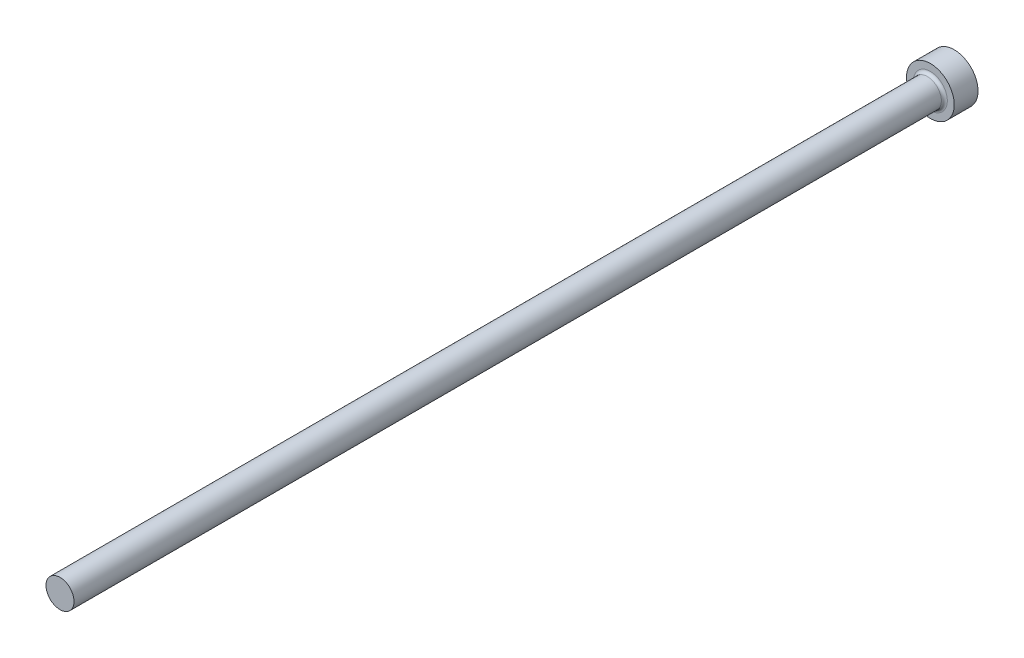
ISO-10303-21;
HEADER;
FILE_DESCRIPTION(('STEP AP214'),'2;1');
FILE_NAME('part.step','',(''),(''),'','','');
FILE_SCHEMA(('AUTOMOTIVE_DESIGN { 1 0 10303 214 1 1 1 1 }'));
ENDSEC;
DATA;
#1=APPLICATION_CONTEXT('core data for automotive mechanical design processes');
#2=APPLICATION_PROTOCOL_DEFINITION('international standard','automotive_design',2000,#1);
#3=PRODUCT_CONTEXT('',#1,'mechanical');
#4=PRODUCT('Part','Part','',(#3));
#5=PRODUCT_RELATED_PRODUCT_CATEGORY('part','',(#4));
#6=PRODUCT_DEFINITION_FORMATION('','',#4);
#7=PRODUCT_DEFINITION_CONTEXT('part definition',#1,'design');
#8=PRODUCT_DEFINITION('design','',#6,#7);
#9=PRODUCT_DEFINITION_SHAPE('','',#8);
#10=(LENGTH_UNIT() NAMED_UNIT(*) SI_UNIT(.MILLI.,.METRE.));
#11=(NAMED_UNIT(*) PLANE_ANGLE_UNIT() SI_UNIT($,.RADIAN.));
#12=(NAMED_UNIT(*) SI_UNIT($,.STERADIAN.) SOLID_ANGLE_UNIT());
#13=UNCERTAINTY_MEASURE_WITH_UNIT(LENGTH_MEASURE(1.E-05),#10,'distance_accuracy_value','');
#14=(GEOMETRIC_REPRESENTATION_CONTEXT(3) GLOBAL_UNCERTAINTY_ASSIGNED_CONTEXT((#13)) GLOBAL_UNIT_ASSIGNED_CONTEXT((#10,
#11,#12)) REPRESENTATION_CONTEXT('',''));
#15=CARTESIAN_POINT('',(0.,0.,0.));
#16=DIRECTION('',(0.,0.,1.));
#17=DIRECTION('',(1.,0.,0.));
#18=AXIS2_PLACEMENT_3D('',#15,#16,#17);
#19=CARTESIAN_POINT('',(4.,0.,4.));
#20=DIRECTION('',(0.,0.,-1.));
#21=DIRECTION('',(-1.,0.,0.));
#22=AXIS2_PLACEMENT_3D('',#19,#20,#21);
#23=PLANE('',#22);
#24=CARTESIAN_POINT('',(0.,0.,4.));
#25=DIRECTION('',(0.,0.,-1.));
#26=DIRECTION('',(-1.,0.,0.));
#27=AXIS2_PLACEMENT_3D('',#24,#25,#26);
#28=CIRCLE('',#27,2.85000000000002);
#29=CARTESIAN_POINT('',(-2.85000000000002,0.,4.));
#30=VERTEX_POINT('',#29);
#31=EDGE_CURVE('E40',#30,#30,#28,.T.);
#32=ORIENTED_EDGE('',*,*,#31,.T.);
#33=EDGE_LOOP('',(#32));
#34=FACE_BOUND('',#33,.T.);
#35=CARTESIAN_POINT('',(0.,0.,4.));
#36=DIRECTION('',(0.,0.,-1.));
#37=DIRECTION('',(-1.,0.,0.));
#38=AXIS2_PLACEMENT_3D('',#35,#36,#37);
#39=CIRCLE('',#38,4.);
#40=CARTESIAN_POINT('',(-4.,0.,4.));
#41=VERTEX_POINT('',#40);
#42=EDGE_CURVE('E44',#41,#41,#39,.T.);
#43=ORIENTED_EDGE('',*,*,#42,.F.);
#44=EDGE_LOOP('',(#43));
#45=FACE_BOUND('',#44,.T.);
#46=ADVANCED_FACE('F33',(#34,#45),#23,.F.);
#47=CARTESIAN_POINT('',(0.,0.,-9.03322817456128));
#48=DIRECTION('',(0.,0.,-1.));
#49=DIRECTION('',(-1.,0.,0.));
#50=AXIS2_PLACEMENT_3D('',#47,#48,#49);
#51=CYLINDRICAL_SURFACE('',#50,4.);
#52=CARTESIAN_POINT('',(0.,0.,0.));
#53=DIRECTION('',(0.,0.,-1.));
#54=DIRECTION('',(-1.,0.,0.));
#55=AXIS2_PLACEMENT_3D('',#52,#53,#54);
#56=CIRCLE('',#55,4.);
#57=CARTESIAN_POINT('',(-4.,0.,0.));
#58=VERTEX_POINT('',#57);
#59=EDGE_CURVE('E48',#58,#58,#56,.T.);
#60=ORIENTED_EDGE('',*,*,#59,.F.);
#61=EDGE_LOOP('',(#60));
#62=FACE_BOUND('',#61,.T.);
#63=ORIENTED_EDGE('',*,*,#42,.T.);
#64=EDGE_LOOP('',(#63));
#65=FACE_BOUND('',#64,.T.);
#66=ADVANCED_FACE('F68',(#62,#65),#51,.T.);
#67=CARTESIAN_POINT('',(0.,0.,0.));
#68=DIRECTION('',(0.,0.,1.));
#69=DIRECTION('',(1.,0.,0.));
#70=AXIS2_PLACEMENT_3D('',#67,#68,#69);
#71=PLANE('',#70);
#72=ORIENTED_EDGE('',*,*,#59,.T.);
#73=EDGE_LOOP('',(#72));
#74=FACE_BOUND('',#73,.T.);
#75=ADVANCED_FACE('F61',(#74),#71,.F.);
#76=CARTESIAN_POINT('',(0.,0.,150.));
#77=DIRECTION('',(0.,0.,-1.));
#78=DIRECTION('',(-1.,0.,0.));
#79=AXIS2_PLACEMENT_3D('',#76,#77,#78);
#80=PLANE('',#79);
#81=CARTESIAN_POINT('',(0.,0.,150.));
#82=DIRECTION('',(0.,0.,-1.));
#83=DIRECTION('',(-1.,0.,0.));
#84=AXIS2_PLACEMENT_3D('',#81,#82,#83);
#85=CIRCLE('',#84,2.35000000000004);
#86=CARTESIAN_POINT('',(-2.35000000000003,0.,150.));
#87=VERTEX_POINT('',#86);
#88=EDGE_CURVE('E53',#87,#87,#85,.T.);
#89=ORIENTED_EDGE('',*,*,#88,.F.);
#90=EDGE_LOOP('',(#89));
#91=FACE_BOUND('',#90,.T.);
#92=ADVANCED_FACE('F59',(#91),#80,.F.);
#93=CARTESIAN_POINT('',(0.,0.,-9.03322817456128));
#94=DIRECTION('',(0.,0.,-1.));
#95=DIRECTION('',(-1.,0.,0.));
#96=AXIS2_PLACEMENT_3D('',#93,#94,#95);
#97=CYLINDRICAL_SURFACE('',#96,2.35000000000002);
#98=CARTESIAN_POINT('',(0.,0.,4.5));
#99=DIRECTION('',(0.,0.,-1.));
#100=DIRECTION('',(-1.,0.,0.));
#101=AXIS2_PLACEMENT_3D('',#98,#99,#100);
#102=CIRCLE('',#101,2.35000000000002);
#103=CARTESIAN_POINT('',(-2.35000000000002,0.,4.5));
#104=VERTEX_POINT('',#103);
#105=EDGE_CURVE('E10',#104,#104,#102,.F.);
#106=ORIENTED_EDGE('',*,*,#105,.T.);
#107=EDGE_LOOP('',(#106));
#108=FACE_BOUND('',#107,.T.);
#109=ORIENTED_EDGE('',*,*,#88,.T.);
#110=EDGE_LOOP('',(#109));
#111=FACE_BOUND('',#110,.T.);
#112=ADVANCED_FACE('F57',(#108,#111),#97,.T.);
#113=CARTESIAN_POINT('',(0.,0.,4.5));
#114=DIRECTION('',(0.,0.,-1.));
#115=DIRECTION('',(-1.,0.,0.));
#116=AXIS2_PLACEMENT_3D('',#113,#114,#115);
#117=TOROIDAL_SURFACE('',#116,2.85000000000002,0.5);
#118=ORIENTED_EDGE('',*,*,#105,.F.);
#119=EDGE_LOOP('',(#118));
#120=FACE_BOUND('',#119,.T.);
#121=ORIENTED_EDGE('',*,*,#31,.F.);
#122=EDGE_LOOP('',(#121));
#123=FACE_BOUND('',#122,.T.);
#124=ADVANCED_FACE('F35',(#120,#123),#117,.F.);
#125=CLOSED_SHELL('',(#46,#66,#75,#92,#112,#124));
#126=MANIFOLD_SOLID_BREP('B2',#125);
#127=ADVANCED_BREP_SHAPE_REPRESENTATION('',(#18,#126),#14);
#128=SHAPE_DEFINITION_REPRESENTATION(#9,#127);
ENDSEC;
END-ISO-10303-21;
